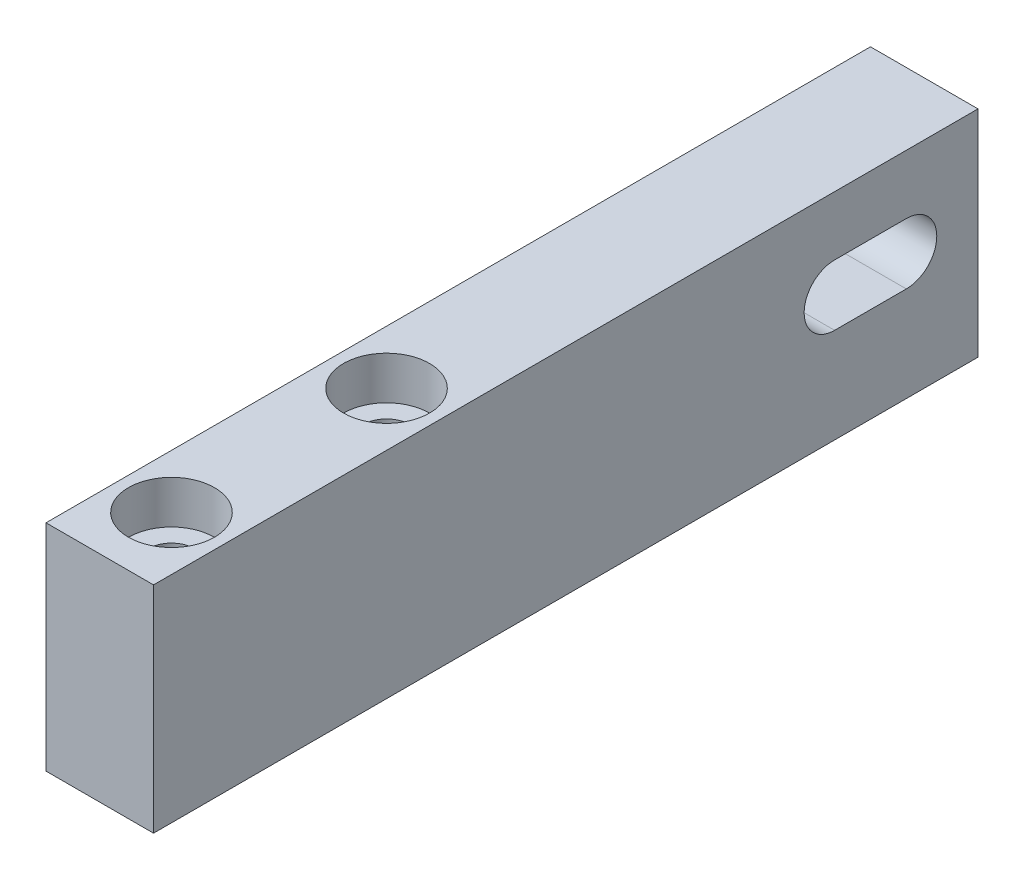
from build123d import *

# Parameters (mm, degrees)
ESQUISSE1_W                             = 15
ESQUISSE1_H                             = 30
EXTRUSION1_DEPTH                        = 115
CHAMBRAGE_POUR_AXES_6_5_MM1_D           = 6.5
CHAMBRAGE_POUR_AXES_6_5_MM1_CBORE_D     = 12
CHAMBRAGE_POUR_AXES_6_5_MM1_CBORE_DEPTH = 6
ENL_V_MAT_EXTRU_1_REACH                 = 121.791


with BuildPart() as part:
    # Esquisse1 → Extrusion1 (new body)
    with BuildSketch(Plane.XY):
        with Locations((7.5, 15)):
            Rectangle(ESQUISSE1_W, ESQUISSE1_H)
    extrude(amount=-EXTRUSION1_DEPTH)

    # Chambrage pour axes 6.5 mm1 (through all)
    with Locations(Plane(origin=(-0.362000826, 30, -44.321502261), x_dir=(1, 0, 0), z_dir=(0, 1, 0))):
        with Locations((7.862000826, -4.321502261), (7.862000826, -34.321502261)):
            CounterBoreHole(CHAMBRAGE_POUR_AXES_6_5_MM1_D / 2, CHAMBRAGE_POUR_AXES_6_5_MM1_CBORE_D / 2, CHAMBRAGE_POUR_AXES_6_5_MM1_CBORE_DEPTH)

    # Esquisse4 → Enl_v. mat.-Extru.1 (cut, up to next)
    with BuildSketch(Plane.ZY, mode=Mode.PRIVATE) as enl_v_mat_extru_1_sk1:
        with BuildLine():
            Line((-105, 13.25), (-95, 13.25))
            ThreePointArc((-95, 13.25), (-90.75, 17.5), (-95, 21.75))
            Line((-95, 21.75), (-105, 21.75))
            ThreePointArc((-105, 21.75), (-109.25, 17.5), (-105, 13.25))
        make_face()
    enl_v_mat_extru_1_tool1 = extrude(enl_v_mat_extru_1_sk1.sketch, amount=-ENL_V_MAT_EXTRU_1_REACH, mode=Mode.PRIVATE) & part.part
    add(enl_v_mat_extru_1_tool1.solids().sort_by_distance((0, 17.5, -100))[0], mode=Mode.SUBTRACT)


solid = part.part
